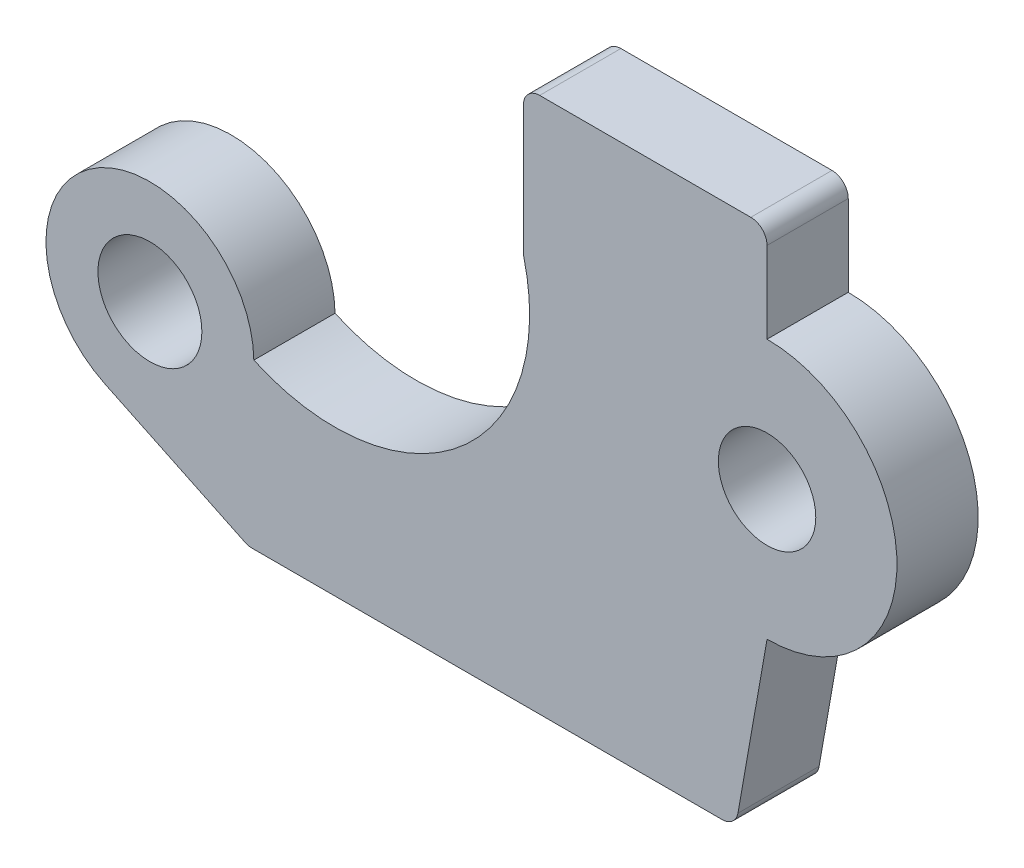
ISO-10303-21;
HEADER;
FILE_DESCRIPTION(('STEP AP214'),'2;1');
FILE_NAME('part.step','',(''),(''),'','','');
FILE_SCHEMA(('AUTOMOTIVE_DESIGN { 1 0 10303 214 1 1 1 1 }'));
ENDSEC;
DATA;
#1=APPLICATION_CONTEXT('core data for automotive mechanical design processes');
#2=APPLICATION_PROTOCOL_DEFINITION('international standard','automotive_design',2000,#1);
#3=PRODUCT_CONTEXT('',#1,'mechanical');
#4=PRODUCT('Part','Part','',(#3));
#5=PRODUCT_RELATED_PRODUCT_CATEGORY('part','',(#4));
#6=PRODUCT_DEFINITION_FORMATION('','',#4);
#7=PRODUCT_DEFINITION_CONTEXT('part definition',#1,'design');
#8=PRODUCT_DEFINITION('design','',#6,#7);
#9=PRODUCT_DEFINITION_SHAPE('','',#8);
#10=(LENGTH_UNIT() NAMED_UNIT(*) SI_UNIT(.MILLI.,.METRE.));
#11=(NAMED_UNIT(*) PLANE_ANGLE_UNIT() SI_UNIT($,.RADIAN.));
#12=(NAMED_UNIT(*) SI_UNIT($,.STERADIAN.) SOLID_ANGLE_UNIT());
#13=UNCERTAINTY_MEASURE_WITH_UNIT(LENGTH_MEASURE(1.E-05),#10,'distance_accuracy_value','');
#14=(GEOMETRIC_REPRESENTATION_CONTEXT(3) GLOBAL_UNCERTAINTY_ASSIGNED_CONTEXT((#13)) GLOBAL_UNIT_ASSIGNED_CONTEXT((#10,
#11,#12)) REPRESENTATION_CONTEXT('',''));
#15=CARTESIAN_POINT('',(0.,0.,0.));
#16=DIRECTION('',(0.,0.,1.));
#17=DIRECTION('',(1.,0.,0.));
#18=AXIS2_PLACEMENT_3D('',#15,#16,#17);
#19=CARTESIAN_POINT('',(0.,0.,2.5));
#20=DIRECTION('',(0.,0.,1.));
#21=DIRECTION('',(1.,0.,0.));
#22=AXIS2_PLACEMENT_3D('',#19,#20,#21);
#23=PLANE('',#22);
#24=CARTESIAN_POINT('',(0.,0.,2.5));
#25=DIRECTION('',(0.,0.,1.));
#26=DIRECTION('',(1.,0.,0.));
#27=AXIS2_PLACEMENT_3D('',#24,#25,#26);
#28=CIRCLE('',#27,1.5);
#29=CARTESIAN_POINT('',(1.5,0.,2.5));
#30=VERTEX_POINT('',#29);
#31=EDGE_CURVE('E254',#30,#30,#28,.T.);
#32=ORIENTED_EDGE('',*,*,#31,.F.);
#33=EDGE_LOOP('',(#32));
#34=FACE_BOUND('',#33,.T.);
#35=DIRECTION('',(0.901845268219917,-0.43205915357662,0.));
#36=VECTOR('',#35,1.);
#37=CARTESIAN_POINT('',(-15.9697983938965,-9.50000000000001,2.5));
#38=LINE('',#37,#36);
#39=CARTESIAN_POINT('',(-20.3825892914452,-7.38590485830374,2.5));
#40=VERTEX_POINT('',#39);
#41=CARTESIAN_POINT('',(-16.072238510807,-9.45092263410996,2.5));
#42=VERTEX_POINT('',#41);
#43=EDGE_CURVE('E246',#40,#42,#38,.T.);
#44=ORIENTED_EDGE('',*,*,#43,.T.);
#45=CARTESIAN_POINT('',(-15.8562089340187,-9.00000000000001,2.5));
#46=DIRECTION('',(0.,0.,1.));
#47=DIRECTION('',(1.,0.,0.));
#48=AXIS2_PLACEMENT_3D('',#45,#46,#47);
#49=CIRCLE('',#48,0.5);
#50=CARTESIAN_POINT('',(-15.8562089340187,-9.50000000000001,2.5));
#51=VERTEX_POINT('',#50);
#52=EDGE_CURVE('E179',#42,#51,#49,.T.);
#53=ORIENTED_EDGE('',*,*,#52,.T.);
#54=DIRECTION('',(1.,0.,0.));
#55=VECTOR('',#54,1.);
#56=CARTESIAN_POINT('',(-0.969798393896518,-9.5,2.5));
#57=LINE('',#56,#55);
#58=CARTESIAN_POINT('',(-1.38934820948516,-9.5,2.5));
#59=VERTEX_POINT('',#58);
#60=EDGE_CURVE('E245',#51,#59,#57,.T.);
#61=ORIENTED_EDGE('',*,*,#60,.T.);
#62=CARTESIAN_POINT('',(-1.38934820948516,-9.,2.5));
#63=DIRECTION('',(0.,0.,1.));
#64=DIRECTION('',(1.,0.,0.));
#65=AXIS2_PLACEMENT_3D('',#62,#63,#64);
#66=CIRCLE('',#65,0.5);
#67=CARTESIAN_POINT('',(-0.896944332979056,-9.08682408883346,2.5));
#68=VERTEX_POINT('',#67);
#69=EDGE_CURVE('E48',#59,#68,#66,.T.);
#70=ORIENTED_EDGE('',*,*,#69,.T.);
#71=DIRECTION('',(0.173648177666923,0.984807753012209,0.));
#72=VECTOR('',#71,1.);
#73=CARTESIAN_POINT('',(0.,-4.,2.5));
#74=LINE('',#73,#72);
#75=CARTESIAN_POINT('',(0.,-4.,2.5));
#76=VERTEX_POINT('',#75);
#77=EDGE_CURVE('E144',#68,#76,#74,.T.);
#78=ORIENTED_EDGE('',*,*,#77,.T.);
#79=CARTESIAN_POINT('',(0.,0.,2.5));
#80=DIRECTION('',(0.,0.,1.));
#81=DIRECTION('',(1.,0.,0.));
#82=AXIS2_PLACEMENT_3D('',#79,#80,#81);
#83=CIRCLE('',#82,4.);
#84=CARTESIAN_POINT('',(0.,4.,2.5));
#85=VERTEX_POINT('',#84);
#86=EDGE_CURVE('E139',#76,#85,#83,.T.);
#87=ORIENTED_EDGE('',*,*,#86,.T.);
#88=DIRECTION('',(0.,1.,0.));
#89=VECTOR('',#88,1.);
#90=CARTESIAN_POINT('',(0.,4.,2.5));
#91=LINE('',#90,#89);
#92=CARTESIAN_POINT('',(0.,6.5,2.5));
#93=VERTEX_POINT('',#92);
#94=EDGE_CURVE('E129',#85,#93,#91,.T.);
#95=ORIENTED_EDGE('',*,*,#94,.T.);
#96=CARTESIAN_POINT('',(-0.5,6.5,2.5));
#97=DIRECTION('',(0.,0.,1.));
#98=DIRECTION('',(1.,0.,0.));
#99=AXIS2_PLACEMENT_3D('',#96,#97,#98);
#100=CIRCLE('',#99,0.5);
#101=CARTESIAN_POINT('',(-0.5,7.,2.5));
#102=VERTEX_POINT('',#101);
#103=EDGE_CURVE('E176',#93,#102,#100,.T.);
#104=ORIENTED_EDGE('',*,*,#103,.T.);
#105=DIRECTION('',(-1.,0.,0.));
#106=VECTOR('',#105,1.);
#107=CARTESIAN_POINT('',(0.,7.,2.5));
#108=LINE('',#107,#106);
#109=CARTESIAN_POINT('',(-7.,7.,2.5));
#110=VERTEX_POINT('',#109);
#111=EDGE_CURVE('E138',#102,#110,#108,.T.);
#112=ORIENTED_EDGE('',*,*,#111,.T.);
#113=CARTESIAN_POINT('',(-7.,6.5,2.5));
#114=DIRECTION('',(0.,0.,1.));
#115=DIRECTION('',(1.,0.,0.));
#116=AXIS2_PLACEMENT_3D('',#113,#114,#115);
#117=CIRCLE('',#116,0.5);
#118=CARTESIAN_POINT('',(-7.5,6.5,2.5));
#119=VERTEX_POINT('',#118);
#120=EDGE_CURVE('E55',#110,#119,#117,.T.);
#121=ORIENTED_EDGE('',*,*,#120,.T.);
#122=DIRECTION('',(0.,-1.,0.));
#123=VECTOR('',#122,1.);
#124=CARTESIAN_POINT('',(-7.5,7.,2.5));
#125=LINE('',#124,#123);
#126=CARTESIAN_POINT('',(-7.5,2.5,2.5));
#127=VERTEX_POINT('',#126);
#128=EDGE_CURVE('E268',#119,#127,#125,.T.);
#129=ORIENTED_EDGE('',*,*,#128,.T.);
#130=CARTESIAN_POINT('',(-13.3094750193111,0.999999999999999,2.5));
#131=DIRECTION('',(0.,0.,-1.));
#132=DIRECTION('',(1.,0.,0.));
#133=AXIS2_PLACEMENT_3D('',#130,#131,#132);
#134=CIRCLE('',#133,6.);
#135=CARTESIAN_POINT('',(-15.8002682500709,-4.45856657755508,2.5));
#136=VERTEX_POINT('',#135);
#137=EDGE_CURVE('E270',#127,#136,#134,.T.);
#138=ORIENTED_EDGE('',*,*,#137,.T.);
#139=CARTESIAN_POINT('',(-19.,-4.5,2.5));
#140=DIRECTION('',(0.,0.,1.));
#141=DIRECTION('',(1.,0.,0.));
#142=AXIS2_PLACEMENT_3D('',#139,#140,#141);
#143=CIRCLE('',#142,3.2);
#144=EDGE_CURVE('E231',#136,#40,#143,.T.);
#145=ORIENTED_EDGE('',*,*,#144,.T.);
#146=EDGE_LOOP('',(#44,#53,#61,#70,#78,#87,#95,#104,#112,#121,#129,#138,#145));
#147=FACE_BOUND('',#146,.T.);
#148=CARTESIAN_POINT('',(-19.,-4.5,2.5));
#149=DIRECTION('',(0.,0.,1.));
#150=DIRECTION('',(1.,0.,0.));
#151=AXIS2_PLACEMENT_3D('',#148,#149,#150);
#152=CIRCLE('',#151,1.6);
#153=CARTESIAN_POINT('',(-17.4,-4.5,2.5));
#154=VERTEX_POINT('',#153);
#155=EDGE_CURVE('E261',#154,#154,#152,.T.);
#156=ORIENTED_EDGE('',*,*,#155,.F.);
#157=EDGE_LOOP('',(#156));
#158=FACE_BOUND('',#157,.T.);
#159=ADVANCED_FACE('F33',(#34,#147,#158),#23,.T.);
#160=CARTESIAN_POINT('',(0.,0.,0.));
#161=DIRECTION('',(0.,0.,1.));
#162=DIRECTION('',(1.,0.,0.));
#163=AXIS2_PLACEMENT_3D('',#160,#161,#162);
#164=PLANE('',#163);
#165=DIRECTION('',(1.,0.,0.));
#166=VECTOR('',#165,1.);
#167=CARTESIAN_POINT('',(-0.969798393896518,-9.5,0.));
#168=LINE('',#167,#166);
#169=CARTESIAN_POINT('',(-15.8562089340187,-9.50000000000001,0.));
#170=VERTEX_POINT('',#169);
#171=CARTESIAN_POINT('',(-1.38934820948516,-9.5,0.));
#172=VERTEX_POINT('',#171);
#173=EDGE_CURVE('E216',#170,#172,#168,.T.);
#174=ORIENTED_EDGE('',*,*,#173,.F.);
#175=CARTESIAN_POINT('',(-15.8562089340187,-9.00000000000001,0.));
#176=DIRECTION('',(0.,0.,1.));
#177=DIRECTION('',(1.,0.,0.));
#178=AXIS2_PLACEMENT_3D('',#175,#176,#177);
#179=CIRCLE('',#178,0.5);
#180=CARTESIAN_POINT('',(-16.072238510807,-9.45092263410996,0.));
#181=VERTEX_POINT('',#180);
#182=EDGE_CURVE('E171',#170,#181,#179,.F.);
#183=ORIENTED_EDGE('',*,*,#182,.T.);
#184=DIRECTION('',(0.901845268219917,-0.43205915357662,0.));
#185=VECTOR('',#184,1.);
#186=CARTESIAN_POINT('',(-15.9697983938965,-9.50000000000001,0.));
#187=LINE('',#186,#185);
#188=CARTESIAN_POINT('',(-20.3825892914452,-7.38590485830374,0.));
#189=VERTEX_POINT('',#188);
#190=EDGE_CURVE('E213',#189,#181,#187,.T.);
#191=ORIENTED_EDGE('',*,*,#190,.F.);
#192=CARTESIAN_POINT('',(-19.,-4.5,0.));
#193=DIRECTION('',(0.,0.,1.));
#194=DIRECTION('',(1.,0.,0.));
#195=AXIS2_PLACEMENT_3D('',#192,#193,#194);
#196=CIRCLE('',#195,3.2);
#197=CARTESIAN_POINT('',(-15.8002682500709,-4.45856657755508,0.));
#198=VERTEX_POINT('',#197);
#199=EDGE_CURVE('E211',#198,#189,#196,.T.);
#200=ORIENTED_EDGE('',*,*,#199,.F.);
#201=CARTESIAN_POINT('',(-13.3094750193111,0.999999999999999,0.));
#202=DIRECTION('',(0.,0.,-1.));
#203=DIRECTION('',(1.,0.,0.));
#204=AXIS2_PLACEMENT_3D('',#201,#202,#203);
#205=CIRCLE('',#204,6.);
#206=CARTESIAN_POINT('',(-7.5,2.5,0.));
#207=VERTEX_POINT('',#206);
#208=EDGE_CURVE('E205',#207,#198,#205,.T.);
#209=ORIENTED_EDGE('',*,*,#208,.F.);
#210=DIRECTION('',(0.,-1.,0.));
#211=VECTOR('',#210,1.);
#212=CARTESIAN_POINT('',(-7.5,7.,0.));
#213=LINE('',#212,#211);
#214=CARTESIAN_POINT('',(-7.5,6.5,0.));
#215=VERTEX_POINT('',#214);
#216=EDGE_CURVE('E202',#215,#207,#213,.T.);
#217=ORIENTED_EDGE('',*,*,#216,.F.);
#218=CARTESIAN_POINT('',(-7.,6.5,0.));
#219=DIRECTION('',(0.,0.,1.));
#220=DIRECTION('',(1.,0.,0.));
#221=AXIS2_PLACEMENT_3D('',#218,#219,#220);
#222=CIRCLE('',#221,0.5);
#223=CARTESIAN_POINT('',(-7.,7.,0.));
#224=VERTEX_POINT('',#223);
#225=EDGE_CURVE('E165',#215,#224,#222,.F.);
#226=ORIENTED_EDGE('',*,*,#225,.T.);
#227=DIRECTION('',(-1.,0.,0.));
#228=VECTOR('',#227,1.);
#229=CARTESIAN_POINT('',(0.,7.,0.));
#230=LINE('',#229,#228);
#231=CARTESIAN_POINT('',(-0.5,7.,0.));
#232=VERTEX_POINT('',#231);
#233=EDGE_CURVE('E194',#232,#224,#230,.T.);
#234=ORIENTED_EDGE('',*,*,#233,.F.);
#235=CARTESIAN_POINT('',(-0.5,6.5,0.));
#236=DIRECTION('',(0.,0.,1.));
#237=DIRECTION('',(1.,0.,0.));
#238=AXIS2_PLACEMENT_3D('',#235,#236,#237);
#239=CIRCLE('',#238,0.5);
#240=CARTESIAN_POINT('',(0.,6.5,0.));
#241=VERTEX_POINT('',#240);
#242=EDGE_CURVE('E167',#232,#241,#239,.F.);
#243=ORIENTED_EDGE('',*,*,#242,.T.);
#244=DIRECTION('',(0.,1.,0.));
#245=VECTOR('',#244,1.);
#246=CARTESIAN_POINT('',(0.,4.,0.));
#247=LINE('',#246,#245);
#248=CARTESIAN_POINT('',(0.,4.,0.));
#249=VERTEX_POINT('',#248);
#250=EDGE_CURVE('E203',#249,#241,#247,.T.);
#251=ORIENTED_EDGE('',*,*,#250,.F.);
#252=CARTESIAN_POINT('',(0.,0.,0.));
#253=DIRECTION('',(0.,0.,1.));
#254=DIRECTION('',(1.,0.,0.));
#255=AXIS2_PLACEMENT_3D('',#252,#253,#254);
#256=CIRCLE('',#255,4.);
#257=CARTESIAN_POINT('',(0.,-4.,0.));
#258=VERTEX_POINT('',#257);
#259=EDGE_CURVE('E152',#258,#249,#256,.T.);
#260=ORIENTED_EDGE('',*,*,#259,.F.);
#261=DIRECTION('',(0.173648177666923,0.984807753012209,0.));
#262=VECTOR('',#261,1.);
#263=CARTESIAN_POINT('',(0.,-4.,0.));
#264=LINE('',#263,#262);
#265=CARTESIAN_POINT('',(-0.896944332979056,-9.08682408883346,0.));
#266=VERTEX_POINT('',#265);
#267=EDGE_CURVE('E148',#266,#258,#264,.T.);
#268=ORIENTED_EDGE('',*,*,#267,.F.);
#269=CARTESIAN_POINT('',(-1.38934820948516,-9.,0.));
#270=DIRECTION('',(0.,0.,1.));
#271=DIRECTION('',(1.,0.,0.));
#272=AXIS2_PLACEMENT_3D('',#269,#270,#271);
#273=CIRCLE('',#272,0.5);
#274=EDGE_CURVE('E169',#266,#172,#273,.F.);
#275=ORIENTED_EDGE('',*,*,#274,.T.);
#276=EDGE_LOOP('',(#174,#183,#191,#200,#209,#217,#226,#234,#243,#251,#260,#268,#275));
#277=FACE_BOUND('',#276,.T.);
#278=CARTESIAN_POINT('',(0.,0.,0.));
#279=DIRECTION('',(0.,0.,1.));
#280=DIRECTION('',(1.,0.,0.));
#281=AXIS2_PLACEMENT_3D('',#278,#279,#280);
#282=CIRCLE('',#281,1.5);
#283=CARTESIAN_POINT('',(1.5,0.,0.));
#284=VERTEX_POINT('',#283);
#285=EDGE_CURVE('E256',#284,#284,#282,.T.);
#286=ORIENTED_EDGE('',*,*,#285,.T.);
#287=EDGE_LOOP('',(#286));
#288=FACE_BOUND('',#287,.T.);
#289=CARTESIAN_POINT('',(-19.,-4.5,0.));
#290=DIRECTION('',(0.,0.,1.));
#291=DIRECTION('',(1.,0.,0.));
#292=AXIS2_PLACEMENT_3D('',#289,#290,#291);
#293=CIRCLE('',#292,1.6);
#294=CARTESIAN_POINT('',(-17.4,-4.5,0.));
#295=VERTEX_POINT('',#294);
#296=EDGE_CURVE('E264',#295,#295,#293,.T.);
#297=ORIENTED_EDGE('',*,*,#296,.T.);
#298=EDGE_LOOP('',(#297));
#299=FACE_BOUND('',#298,.T.);
#300=ADVANCED_FACE('F199',(#277,#288,#299),#164,.F.);
#301=CARTESIAN_POINT('',(0.,0.,2.5));
#302=DIRECTION('',(0.,0.,-1.));
#303=DIRECTION('',(-1.,0.,0.));
#304=AXIS2_PLACEMENT_3D('',#301,#302,#303);
#305=CYLINDRICAL_SURFACE('',#304,4.);
#306=ORIENTED_EDGE('',*,*,#259,.T.);
#307=DIRECTION('',(0.,0.,-1.));
#308=VECTOR('',#307,1.);
#309=CARTESIAN_POINT('',(0.,4.,2.5));
#310=LINE('',#309,#308);
#311=EDGE_CURVE('E134',#85,#249,#310,.T.);
#312=ORIENTED_EDGE('',*,*,#311,.F.);
#313=ORIENTED_EDGE('',*,*,#86,.F.);
#314=DIRECTION('',(0.,0.,-1.));
#315=VECTOR('',#314,1.);
#316=CARTESIAN_POINT('',(0.,-4.,2.5));
#317=LINE('',#316,#315);
#318=EDGE_CURVE('E220',#76,#258,#317,.T.);
#319=ORIENTED_EDGE('',*,*,#318,.T.);
#320=EDGE_LOOP('',(#306,#312,#313,#319));
#321=FACE_BOUND('',#320,.T.);
#322=ADVANCED_FACE('F150',(#321),#305,.T.);
#323=CARTESIAN_POINT('',(0.,4.,2.5));
#324=DIRECTION('',(-1.,0.,0.));
#325=DIRECTION('',(0.,0.,1.));
#326=AXIS2_PLACEMENT_3D('',#323,#324,#325);
#327=PLANE('',#326);
#328=ORIENTED_EDGE('',*,*,#250,.T.);
#329=DIRECTION('',(0.,0.,-1.));
#330=VECTOR('',#329,1.);
#331=CARTESIAN_POINT('',(0.,6.5,2.5));
#332=LINE('',#331,#330);
#333=EDGE_CURVE('E41',#241,#93,#332,.F.);
#334=ORIENTED_EDGE('',*,*,#333,.T.);
#335=ORIENTED_EDGE('',*,*,#94,.F.);
#336=ORIENTED_EDGE('',*,*,#311,.T.);
#337=EDGE_LOOP('',(#328,#334,#335,#336));
#338=FACE_BOUND('',#337,.T.);
#339=ADVANCED_FACE('F132',(#338),#327,.F.);
#340=CARTESIAN_POINT('',(0.,7.,2.5));
#341=DIRECTION('',(0.,-1.,0.));
#342=DIRECTION('',(1.,0.,0.));
#343=AXIS2_PLACEMENT_3D('',#340,#341,#342);
#344=PLANE('',#343);
#345=ORIENTED_EDGE('',*,*,#111,.F.);
#346=DIRECTION('',(0.,0.,-1.));
#347=VECTOR('',#346,1.);
#348=CARTESIAN_POINT('',(-0.5,7.,2.5));
#349=LINE('',#348,#347);
#350=EDGE_CURVE('E186',#102,#232,#349,.T.);
#351=ORIENTED_EDGE('',*,*,#350,.T.);
#352=ORIENTED_EDGE('',*,*,#233,.T.);
#353=DIRECTION('',(0.,0.,-1.));
#354=VECTOR('',#353,1.);
#355=CARTESIAN_POINT('',(-7.,7.,2.5));
#356=LINE('',#355,#354);
#357=EDGE_CURVE('E184',#224,#110,#356,.F.);
#358=ORIENTED_EDGE('',*,*,#357,.T.);
#359=EDGE_LOOP('',(#345,#351,#352,#358));
#360=FACE_BOUND('',#359,.T.);
#361=ADVANCED_FACE('F193',(#360),#344,.F.);
#362=CARTESIAN_POINT('',(-7.5,7.,2.5));
#363=DIRECTION('',(1.,0.,0.));
#364=DIRECTION('',(0.,1.,0.));
#365=AXIS2_PLACEMENT_3D('',#362,#363,#364);
#366=PLANE('',#365);
#367=ORIENTED_EDGE('',*,*,#128,.F.);
#368=DIRECTION('',(0.,0.,-1.));
#369=VECTOR('',#368,1.);
#370=CARTESIAN_POINT('',(-7.5,6.5,2.5));
#371=LINE('',#370,#369);
#372=EDGE_CURVE('E11',#119,#215,#371,.T.);
#373=ORIENTED_EDGE('',*,*,#372,.T.);
#374=ORIENTED_EDGE('',*,*,#216,.T.);
#375=DIRECTION('',(0.,0.,-1.));
#376=VECTOR('',#375,1.);
#377=CARTESIAN_POINT('',(-7.5,2.5,2.5));
#378=LINE('',#377,#376);
#379=EDGE_CURVE('E154',#127,#207,#378,.T.);
#380=ORIENTED_EDGE('',*,*,#379,.F.);
#381=EDGE_LOOP('',(#367,#373,#374,#380));
#382=FACE_BOUND('',#381,.T.);
#383=ADVANCED_FACE('F274',(#382),#366,.F.);
#384=CARTESIAN_POINT('',(-13.3094750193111,0.999999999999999,2.5));
#385=DIRECTION('',(0.,0.,-1.));
#386=DIRECTION('',(-1.,0.,0.));
#387=AXIS2_PLACEMENT_3D('',#384,#385,#386);
#388=CYLINDRICAL_SURFACE('',#387,6.);
#389=ORIENTED_EDGE('',*,*,#208,.T.);
#390=DIRECTION('',(0.,0.,-1.));
#391=VECTOR('',#390,1.);
#392=CARTESIAN_POINT('',(-15.8002682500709,-4.45856657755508,2.5));
#393=LINE('',#392,#391);
#394=EDGE_CURVE('E159',#136,#198,#393,.T.);
#395=ORIENTED_EDGE('',*,*,#394,.F.);
#396=ORIENTED_EDGE('',*,*,#137,.F.);
#397=ORIENTED_EDGE('',*,*,#379,.T.);
#398=EDGE_LOOP('',(#389,#395,#396,#397));
#399=FACE_BOUND('',#398,.T.);
#400=ADVANCED_FACE('F272',(#399),#388,.F.);
#401=CARTESIAN_POINT('',(-19.,-4.5,2.5));
#402=DIRECTION('',(0.,0.,-1.));
#403=DIRECTION('',(-1.,0.,0.));
#404=AXIS2_PLACEMENT_3D('',#401,#402,#403);
#405=CYLINDRICAL_SURFACE('',#404,3.2);
#406=ORIENTED_EDGE('',*,*,#199,.T.);
#407=DIRECTION('',(0.,0.,-1.));
#408=VECTOR('',#407,1.);
#409=CARTESIAN_POINT('',(-20.3825892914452,-7.38590485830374,2.5));
#410=LINE('',#409,#408);
#411=EDGE_CURVE('E222',#40,#189,#410,.T.);
#412=ORIENTED_EDGE('',*,*,#411,.F.);
#413=ORIENTED_EDGE('',*,*,#144,.F.);
#414=ORIENTED_EDGE('',*,*,#394,.T.);
#415=EDGE_LOOP('',(#406,#412,#413,#414));
#416=FACE_BOUND('',#415,.T.);
#417=ADVANCED_FACE('F229',(#416),#405,.T.);
#418=CARTESIAN_POINT('',(-15.9697983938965,-9.50000000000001,2.5));
#419=DIRECTION('',(0.432059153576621,0.901845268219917,0.));
#420=DIRECTION('',(-0.901845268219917,0.432059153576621,0.));
#421=AXIS2_PLACEMENT_3D('',#418,#419,#420);
#422=PLANE('',#421);
#423=ORIENTED_EDGE('',*,*,#190,.T.);
#424=DIRECTION('',(0.,0.,-1.));
#425=VECTOR('',#424,1.);
#426=CARTESIAN_POINT('',(-16.072238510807,-9.45092263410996,2.5));
#427=LINE('',#426,#425);
#428=EDGE_CURVE('E173',#181,#42,#427,.F.);
#429=ORIENTED_EDGE('',*,*,#428,.T.);
#430=ORIENTED_EDGE('',*,*,#43,.F.);
#431=ORIENTED_EDGE('',*,*,#411,.T.);
#432=EDGE_LOOP('',(#423,#429,#430,#431));
#433=FACE_BOUND('',#432,.T.);
#434=ADVANCED_FACE('F238',(#433),#422,.F.);
#435=CARTESIAN_POINT('',(-0.969798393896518,-9.5,2.5));
#436=DIRECTION('',(0.,1.,0.));
#437=DIRECTION('',(-1.,0.,0.));
#438=AXIS2_PLACEMENT_3D('',#435,#436,#437);
#439=PLANE('',#438);
#440=ORIENTED_EDGE('',*,*,#60,.F.);
#441=DIRECTION('',(0.,0.,-1.));
#442=VECTOR('',#441,1.);
#443=CARTESIAN_POINT('',(-15.8562089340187,-9.50000000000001,2.5));
#444=LINE('',#443,#442);
#445=EDGE_CURVE('E156',#51,#170,#444,.T.);
#446=ORIENTED_EDGE('',*,*,#445,.T.);
#447=ORIENTED_EDGE('',*,*,#173,.T.);
#448=DIRECTION('',(0.,0.,-1.));
#449=VECTOR('',#448,1.);
#450=CARTESIAN_POINT('',(-1.38934820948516,-9.5,2.5));
#451=LINE('',#450,#449);
#452=EDGE_CURVE('E153',#172,#59,#451,.F.);
#453=ORIENTED_EDGE('',*,*,#452,.T.);
#454=EDGE_LOOP('',(#440,#446,#447,#453));
#455=FACE_BOUND('',#454,.T.);
#456=ADVANCED_FACE('F248',(#455),#439,.F.);
#457=CARTESIAN_POINT('',(0.,-4.,2.5));
#458=DIRECTION('',(-0.984807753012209,0.173648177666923,0.));
#459=DIRECTION('',(-0.173648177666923,-0.984807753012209,0.));
#460=AXIS2_PLACEMENT_3D('',#457,#458,#459);
#461=PLANE('',#460);
#462=ORIENTED_EDGE('',*,*,#77,.F.);
#463=DIRECTION('',(0.,0.,-1.));
#464=VECTOR('',#463,1.);
#465=CARTESIAN_POINT('',(-0.896944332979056,-9.08682408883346,2.5));
#466=LINE('',#465,#464);
#467=EDGE_CURVE('E181',#68,#266,#466,.T.);
#468=ORIENTED_EDGE('',*,*,#467,.T.);
#469=ORIENTED_EDGE('',*,*,#267,.T.);
#470=ORIENTED_EDGE('',*,*,#318,.F.);
#471=EDGE_LOOP('',(#462,#468,#469,#470));
#472=FACE_BOUND('',#471,.T.);
#473=ADVANCED_FACE('F297',(#472),#461,.F.);
#474=CARTESIAN_POINT('',(0.,0.,2.5));
#475=DIRECTION('',(0.,0.,-1.));
#476=DIRECTION('',(-1.,0.,0.));
#477=AXIS2_PLACEMENT_3D('',#474,#475,#476);
#478=CYLINDRICAL_SURFACE('',#477,1.5);
#479=ORIENTED_EDGE('',*,*,#31,.T.);
#480=EDGE_LOOP('',(#479));
#481=FACE_BOUND('',#480,.T.);
#482=ORIENTED_EDGE('',*,*,#285,.F.);
#483=EDGE_LOOP('',(#482));
#484=FACE_BOUND('',#483,.T.);
#485=ADVANCED_FACE('F294',(#481,#484),#478,.F.);
#486=CARTESIAN_POINT('',(-19.,-4.5,2.5));
#487=DIRECTION('',(0.,0.,-1.));
#488=DIRECTION('',(-1.,0.,0.));
#489=AXIS2_PLACEMENT_3D('',#486,#487,#488);
#490=CYLINDRICAL_SURFACE('',#489,1.6);
#491=ORIENTED_EDGE('',*,*,#155,.T.);
#492=EDGE_LOOP('',(#491));
#493=FACE_BOUND('',#492,.T.);
#494=ORIENTED_EDGE('',*,*,#296,.F.);
#495=EDGE_LOOP('',(#494));
#496=FACE_BOUND('',#495,.T.);
#497=ADVANCED_FACE('F318',(#493,#496),#490,.F.);
#498=CARTESIAN_POINT('',(-15.8562089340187,-9.00000000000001,2.5));
#499=DIRECTION('',(0.,0.,-1.));
#500=DIRECTION('',(-1.,0.,0.));
#501=AXIS2_PLACEMENT_3D('',#498,#499,#500);
#502=CYLINDRICAL_SURFACE('',#501,0.5);
#503=ORIENTED_EDGE('',*,*,#52,.F.);
#504=ORIENTED_EDGE('',*,*,#428,.F.);
#505=ORIENTED_EDGE('',*,*,#182,.F.);
#506=ORIENTED_EDGE('',*,*,#445,.F.);
#507=EDGE_LOOP('',(#503,#504,#505,#506));
#508=FACE_BOUND('',#507,.T.);
#509=ADVANCED_FACE('F242',(#508),#502,.T.);
#510=CARTESIAN_POINT('',(-1.38934820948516,-9.,2.5));
#511=DIRECTION('',(0.,0.,-1.));
#512=DIRECTION('',(-1.,0.,0.));
#513=AXIS2_PLACEMENT_3D('',#510,#511,#512);
#514=CYLINDRICAL_SURFACE('',#513,0.5);
#515=ORIENTED_EDGE('',*,*,#69,.F.);
#516=ORIENTED_EDGE('',*,*,#452,.F.);
#517=ORIENTED_EDGE('',*,*,#274,.F.);
#518=ORIENTED_EDGE('',*,*,#467,.F.);
#519=EDGE_LOOP('',(#515,#516,#517,#518));
#520=FACE_BOUND('',#519,.T.);
#521=ADVANCED_FACE('F279',(#520),#514,.T.);
#522=CARTESIAN_POINT('',(-0.5,6.5,2.5));
#523=DIRECTION('',(0.,0.,-1.));
#524=DIRECTION('',(-1.,0.,0.));
#525=AXIS2_PLACEMENT_3D('',#522,#523,#524);
#526=CYLINDRICAL_SURFACE('',#525,0.5);
#527=ORIENTED_EDGE('',*,*,#103,.F.);
#528=ORIENTED_EDGE('',*,*,#333,.F.);
#529=ORIENTED_EDGE('',*,*,#242,.F.);
#530=ORIENTED_EDGE('',*,*,#350,.F.);
#531=EDGE_LOOP('',(#527,#528,#529,#530));
#532=FACE_BOUND('',#531,.T.);
#533=ADVANCED_FACE('F277',(#532),#526,.T.);
#534=CARTESIAN_POINT('',(-7.,6.5,2.5));
#535=DIRECTION('',(0.,0.,-1.));
#536=DIRECTION('',(-1.,0.,0.));
#537=AXIS2_PLACEMENT_3D('',#534,#535,#536);
#538=CYLINDRICAL_SURFACE('',#537,0.5);
#539=ORIENTED_EDGE('',*,*,#120,.F.);
#540=ORIENTED_EDGE('',*,*,#357,.F.);
#541=ORIENTED_EDGE('',*,*,#225,.F.);
#542=ORIENTED_EDGE('',*,*,#372,.F.);
#543=EDGE_LOOP('',(#539,#540,#541,#542));
#544=FACE_BOUND('',#543,.T.);
#545=ADVANCED_FACE('F35',(#544),#538,.T.);
#546=CLOSED_SHELL('',(#159,#300,#322,#339,#361,#383,#400,#417,#434,#456,#473,#485,#497,#509,
#521,#533,#545));
#547=MANIFOLD_SOLID_BREP('B2',#546);
#548=ADVANCED_BREP_SHAPE_REPRESENTATION('',(#18,#547),#14);
#549=SHAPE_DEFINITION_REPRESENTATION(#9,#548);
ENDSEC;
END-ISO-10303-21;
